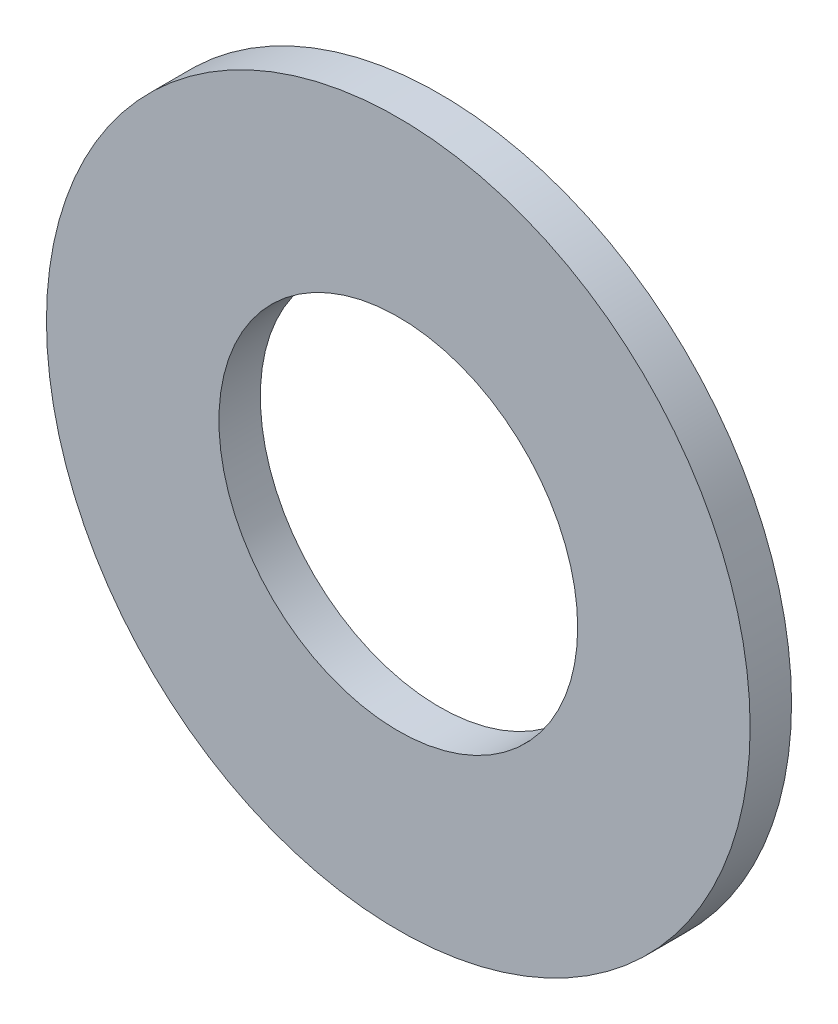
ISO-10303-21;
HEADER;
FILE_DESCRIPTION(('STEP AP214'),'2;1');
FILE_NAME('part.step','',(''),(''),'','','');
FILE_SCHEMA(('AUTOMOTIVE_DESIGN { 1 0 10303 214 1 1 1 1 }'));
ENDSEC;
DATA;
#1=APPLICATION_CONTEXT('core data for automotive mechanical design processes');
#2=APPLICATION_PROTOCOL_DEFINITION('international standard','automotive_design',2000,#1);
#3=PRODUCT_CONTEXT('',#1,'mechanical');
#4=PRODUCT('Part','Part','',(#3));
#5=PRODUCT_RELATED_PRODUCT_CATEGORY('part','',(#4));
#6=PRODUCT_DEFINITION_FORMATION('','',#4);
#7=PRODUCT_DEFINITION_CONTEXT('part definition',#1,'design');
#8=PRODUCT_DEFINITION('design','',#6,#7);
#9=PRODUCT_DEFINITION_SHAPE('','',#8);
#10=(LENGTH_UNIT() NAMED_UNIT(*) SI_UNIT(.MILLI.,.METRE.));
#11=(NAMED_UNIT(*) PLANE_ANGLE_UNIT() SI_UNIT($,.RADIAN.));
#12=(NAMED_UNIT(*) SI_UNIT($,.STERADIAN.) SOLID_ANGLE_UNIT());
#13=UNCERTAINTY_MEASURE_WITH_UNIT(LENGTH_MEASURE(1.E-05),#10,'distance_accuracy_value','');
#14=(GEOMETRIC_REPRESENTATION_CONTEXT(3) GLOBAL_UNCERTAINTY_ASSIGNED_CONTEXT((#13)) GLOBAL_UNIT_ASSIGNED_CONTEXT((#10,
#11,#12)) REPRESENTATION_CONTEXT('',''));
#15=CARTESIAN_POINT('',(0.,0.,0.));
#16=DIRECTION('',(0.,0.,1.));
#17=DIRECTION('',(1.,0.,0.));
#18=AXIS2_PLACEMENT_3D('',#15,#16,#17);
#19=CARTESIAN_POINT('',(0.,0.,0.6));
#20=DIRECTION('',(0.,0.,-1.));
#21=DIRECTION('',(-1.,0.,0.));
#22=AXIS2_PLACEMENT_3D('',#19,#20,#21);
#23=PLANE('',#22);
#24=CARTESIAN_POINT('',(0.,0.,0.6));
#25=DIRECTION('',(0.,0.,1.));
#26=DIRECTION('',(1.,0.,0.));
#27=AXIS2_PLACEMENT_3D('',#24,#25,#26);
#28=CIRCLE('',#27,2.6);
#29=CARTESIAN_POINT('',(2.6,0.,0.6));
#30=VERTEX_POINT('',#29);
#31=EDGE_CURVE('E29',#30,#30,#28,.F.);
#32=ORIENTED_EDGE('',*,*,#31,.T.);
#33=EDGE_LOOP('',(#32));
#34=FACE_BOUND('',#33,.T.);
#35=CARTESIAN_POINT('',(0.,0.,0.6));
#36=DIRECTION('',(0.,0.,1.));
#37=DIRECTION('',(1.,0.,0.));
#38=AXIS2_PLACEMENT_3D('',#35,#36,#37);
#39=CIRCLE('',#38,5.1);
#40=CARTESIAN_POINT('',(5.1,0.,0.6));
#41=VERTEX_POINT('',#40);
#42=EDGE_CURVE('E20',#41,#41,#39,.F.);
#43=ORIENTED_EDGE('',*,*,#42,.F.);
#44=EDGE_LOOP('',(#43));
#45=FACE_BOUND('',#44,.T.);
#46=ADVANCED_FACE('F17',(#34,#45),#23,.F.);
#47=CARTESIAN_POINT('',(0.,0.,0.));
#48=DIRECTION('',(0.,0.,1.));
#49=DIRECTION('',(1.,0.,0.));
#50=AXIS2_PLACEMENT_3D('',#47,#48,#49);
#51=CYLINDRICAL_SURFACE('',#50,5.1);
#52=CARTESIAN_POINT('',(0.,0.,0.));
#53=DIRECTION('',(0.,0.,1.));
#54=DIRECTION('',(1.,0.,0.));
#55=AXIS2_PLACEMENT_3D('',#52,#53,#54);
#56=CIRCLE('',#55,5.1);
#57=CARTESIAN_POINT('',(5.1,0.,0.));
#58=VERTEX_POINT('',#57);
#59=EDGE_CURVE('E24',#58,#58,#56,.F.);
#60=ORIENTED_EDGE('',*,*,#59,.F.);
#61=EDGE_LOOP('',(#60));
#62=FACE_BOUND('',#61,.T.);
#63=ORIENTED_EDGE('',*,*,#42,.T.);
#64=EDGE_LOOP('',(#63));
#65=FACE_BOUND('',#64,.T.);
#66=ADVANCED_FACE('F37',(#62,#65),#51,.T.);
#67=CARTESIAN_POINT('',(0.,0.,0.));
#68=DIRECTION('',(0.,0.,1.));
#69=DIRECTION('',(1.,0.,0.));
#70=AXIS2_PLACEMENT_3D('',#67,#68,#69);
#71=CYLINDRICAL_SURFACE('',#70,2.6);
#72=ORIENTED_EDGE('',*,*,#31,.F.);
#73=EDGE_LOOP('',(#72));
#74=FACE_BOUND('',#73,.T.);
#75=CARTESIAN_POINT('',(0.,0.,0.));
#76=DIRECTION('',(0.,0.,1.));
#77=DIRECTION('',(1.,0.,0.));
#78=AXIS2_PLACEMENT_3D('',#75,#76,#77);
#79=CIRCLE('',#78,2.6);
#80=CARTESIAN_POINT('',(2.6,0.,0.));
#81=VERTEX_POINT('',#80);
#82=EDGE_CURVE('E10',#81,#81,#79,.T.);
#83=ORIENTED_EDGE('',*,*,#82,.F.);
#84=EDGE_LOOP('',(#83));
#85=FACE_BOUND('',#84,.T.);
#86=ADVANCED_FACE('F44',(#74,#85),#71,.F.);
#87=CARTESIAN_POINT('',(0.,0.,0.));
#88=DIRECTION('',(0.,0.,-1.));
#89=DIRECTION('',(-1.,0.,0.));
#90=AXIS2_PLACEMENT_3D('',#87,#88,#89);
#91=PLANE('',#90);
#92=ORIENTED_EDGE('',*,*,#82,.T.);
#93=EDGE_LOOP('',(#92));
#94=FACE_BOUND('',#93,.T.);
#95=ORIENTED_EDGE('',*,*,#59,.T.);
#96=EDGE_LOOP('',(#95));
#97=FACE_BOUND('',#96,.T.);
#98=ADVANCED_FACE('F46',(#94,#97),#91,.T.);
#99=CLOSED_SHELL('',(#46,#66,#86,#98));
#100=MANIFOLD_SOLID_BREP('B1',#99);
#101=ADVANCED_BREP_SHAPE_REPRESENTATION('',(#18,#100),#14);
#102=SHAPE_DEFINITION_REPRESENTATION(#9,#101);
ENDSEC;
END-ISO-10303-21;
